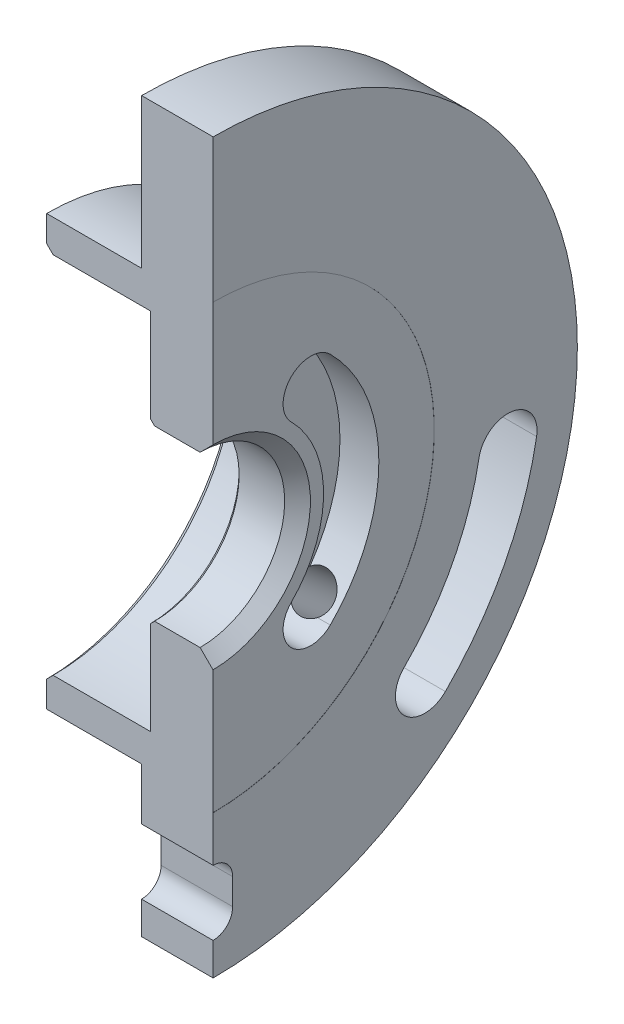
ISO-10303-21;
HEADER;
FILE_DESCRIPTION(('STEP AP214'),'2;1');
FILE_NAME('part.step','',(''),(''),'','','');
FILE_SCHEMA(('AUTOMOTIVE_DESIGN { 1 0 10303 214 1 1 1 1 }'));
ENDSEC;
DATA;
#1=APPLICATION_CONTEXT('core data for automotive mechanical design processes');
#2=APPLICATION_PROTOCOL_DEFINITION('international standard','automotive_design',2000,#1);
#3=PRODUCT_CONTEXT('',#1,'mechanical');
#4=PRODUCT('Part','Part','',(#3));
#5=PRODUCT_RELATED_PRODUCT_CATEGORY('part','',(#4));
#6=PRODUCT_DEFINITION_FORMATION('','',#4);
#7=PRODUCT_DEFINITION_CONTEXT('part definition',#1,'design');
#8=PRODUCT_DEFINITION('design','',#6,#7);
#9=PRODUCT_DEFINITION_SHAPE('','',#8);
#10=(LENGTH_UNIT() NAMED_UNIT(*) SI_UNIT(.MILLI.,.METRE.));
#11=(NAMED_UNIT(*) PLANE_ANGLE_UNIT() SI_UNIT($,.RADIAN.));
#12=(NAMED_UNIT(*) SI_UNIT($,.STERADIAN.) SOLID_ANGLE_UNIT());
#13=UNCERTAINTY_MEASURE_WITH_UNIT(LENGTH_MEASURE(1.E-05),#10,'distance_accuracy_value','');
#14=(GEOMETRIC_REPRESENTATION_CONTEXT(3) GLOBAL_UNCERTAINTY_ASSIGNED_CONTEXT((#13)) GLOBAL_UNIT_ASSIGNED_CONTEXT((#10,
#11,#12)) REPRESENTATION_CONTEXT('',''));
#15=CARTESIAN_POINT('',(0.,0.,0.));
#16=DIRECTION('',(0.,0.,1.));
#17=DIRECTION('',(1.,0.,0.));
#18=AXIS2_PLACEMENT_3D('',#15,#16,#17);
#19=CARTESIAN_POINT('',(5.50000000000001,0.,0.));
#20=DIRECTION('',(1.,0.,0.));
#21=DIRECTION('',(0.,0.,-1.));
#22=AXIS2_PLACEMENT_3D('',#19,#20,#21);
#23=CONICAL_SURFACE('',#22,7.5,0.78539816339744);
#24=DIRECTION('',(-0.707106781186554,0.707106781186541,0.));
#25=VECTOR('',#24,1.);
#26=CARTESIAN_POINT('',(-2.00000000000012,0.,0.));
#27=LINE('',#26,#25);
#28=CARTESIAN_POINT('',(5.49,-7.48999999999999,0.));
#29=VERTEX_POINT('',#28);
#30=CARTESIAN_POINT('',(4.49999999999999,-6.5,0.));
#31=VERTEX_POINT('',#30);
#32=EDGE_CURVE('E853',#29,#31,#27,.T.);
#33=ORIENTED_EDGE('',*,*,#32,.F.);
#34=CARTESIAN_POINT('',(5.49,0.,0.));
#35=DIRECTION('',(1.,0.,0.));
#36=DIRECTION('',(0.,0.,-1.));
#37=AXIS2_PLACEMENT_3D('',#34,#35,#36);
#38=CIRCLE('',#37,7.48999999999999);
#39=CARTESIAN_POINT('',(5.49,7.48999999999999,0.));
#40=VERTEX_POINT('',#39);
#41=EDGE_CURVE('E545',#29,#40,#38,.T.);
#42=ORIENTED_EDGE('',*,*,#41,.T.);
#43=DIRECTION('',(0.707106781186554,0.707106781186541,0.));
#44=VECTOR('',#43,1.);
#45=CARTESIAN_POINT('',(-2.00000000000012,0.,0.));
#46=LINE('',#45,#44);
#47=CARTESIAN_POINT('',(4.49999999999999,6.5,0.));
#48=VERTEX_POINT('',#47);
#49=EDGE_CURVE('E813',#48,#40,#46,.T.);
#50=ORIENTED_EDGE('',*,*,#49,.F.);
#51=CARTESIAN_POINT('',(4.49999999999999,0.,0.));
#52=DIRECTION('',(-1.,0.,0.));
#53=DIRECTION('',(0.,0.,1.));
#54=AXIS2_PLACEMENT_3D('',#51,#52,#53);
#55=CIRCLE('',#54,6.5);
#56=EDGE_CURVE('E718',#31,#48,#55,.F.);
#57=ORIENTED_EDGE('',*,*,#56,.F.);
#58=EDGE_LOOP('',(#33,#42,#50,#57));
#59=FACE_BOUND('',#58,.T.);
#60=ADVANCED_FACE('F356',(#59),#23,.F.);
#61=CARTESIAN_POINT('',(2.5,0.,0.));
#62=DIRECTION('',(1.,0.,0.));
#63=DIRECTION('',(0.,0.,-1.));
#64=AXIS2_PLACEMENT_3D('',#61,#62,#63);
#65=CYLINDRICAL_SURFACE('',#64,8.5);
#66=CARTESIAN_POINT('',(5.49,0.,0.));
#67=DIRECTION('',(1.,0.,0.));
#68=DIRECTION('',(0.,0.,-1.));
#69=AXIS2_PLACEMENT_3D('',#66,#67,#68);
#70=CIRCLE('',#69,8.5);
#71=CARTESIAN_POINT('',(5.49,-6.01040764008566,-6.01040764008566));
#72=VERTEX_POINT('',#71);
#73=CARTESIAN_POINT('',(5.49,6.01040764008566,-6.01040764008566));
#74=VERTEX_POINT('',#73);
#75=EDGE_CURVE('E560',#72,#74,#70,.T.);
#76=ORIENTED_EDGE('',*,*,#75,.F.);
#77=DIRECTION('',(1.,0.,0.));
#78=VECTOR('',#77,1.);
#79=CARTESIAN_POINT('',(2.5,-6.01040764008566,-6.01040764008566));
#80=LINE('',#79,#78);
#81=CARTESIAN_POINT('',(2.5,-6.01040764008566,-6.01040764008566));
#82=VERTEX_POINT('',#81);
#83=EDGE_CURVE('E757',#82,#72,#80,.T.);
#84=ORIENTED_EDGE('',*,*,#83,.F.);
#85=CARTESIAN_POINT('',(2.5,0.,0.));
#86=DIRECTION('',(-1.,0.,0.));
#87=DIRECTION('',(0.,0.,1.));
#88=AXIS2_PLACEMENT_3D('',#85,#86,#87);
#89=CIRCLE('',#88,8.5);
#90=CARTESIAN_POINT('',(2.5,6.01040764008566,-6.01040764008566));
#91=VERTEX_POINT('',#90);
#92=EDGE_CURVE('E1022',#91,#82,#89,.T.);
#93=ORIENTED_EDGE('',*,*,#92,.F.);
#94=DIRECTION('',(1.,0.,0.));
#95=VECTOR('',#94,1.);
#96=CARTESIAN_POINT('',(2.5,6.01040764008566,-6.01040764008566));
#97=LINE('',#96,#95);
#98=EDGE_CURVE('E759',#91,#74,#97,.T.);
#99=ORIENTED_EDGE('',*,*,#98,.T.);
#100=EDGE_LOOP('',(#76,#84,#93,#99));
#101=FACE_BOUND('',#100,.T.);
#102=ADVANCED_FACE('F643',(#101),#65,.T.);
#103=CARTESIAN_POINT('',(2.5,7.51300955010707,-7.51300955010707));
#104=DIRECTION('',(1.,0.,0.));
#105=DIRECTION('',(0.,0.,-1.));
#106=AXIS2_PLACEMENT_3D('',#103,#104,#105);
#107=CYLINDRICAL_SURFACE('',#106,2.125);
#108=CARTESIAN_POINT('',(5.49,7.51300955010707,-7.51300955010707));
#109=DIRECTION('',(1.,0.,0.));
#110=DIRECTION('',(0.,0.,-1.));
#111=AXIS2_PLACEMENT_3D('',#108,#109,#110);
#112=CIRCLE('',#111,2.125);
#113=CARTESIAN_POINT('',(5.49,9.01561146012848,-9.01561146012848));
#114=VERTEX_POINT('',#113);
#115=EDGE_CURVE('E553',#74,#114,#112,.F.);
#116=ORIENTED_EDGE('',*,*,#115,.F.);
#117=ORIENTED_EDGE('',*,*,#98,.F.);
#118=CARTESIAN_POINT('',(2.5,7.51300955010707,-7.51300955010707));
#119=DIRECTION('',(1.,0.,0.));
#120=DIRECTION('',(0.,0.,1.));
#121=AXIS2_PLACEMENT_3D('',#118,#119,#120);
#122=CIRCLE('',#121,2.125);
#123=CARTESIAN_POINT('',(2.5,9.01561146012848,-9.01561146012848));
#124=VERTEX_POINT('',#123);
#125=EDGE_CURVE('E764',#124,#91,#122,.T.);
#126=ORIENTED_EDGE('',*,*,#125,.F.);
#127=DIRECTION('',(1.,0.,0.));
#128=VECTOR('',#127,1.);
#129=CARTESIAN_POINT('',(2.5,9.01561146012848,-9.01561146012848));
#130=LINE('',#129,#128);
#131=EDGE_CURVE('E766',#124,#114,#130,.T.);
#132=ORIENTED_EDGE('',*,*,#131,.T.);
#133=EDGE_LOOP('',(#116,#117,#126,#132));
#134=FACE_BOUND('',#133,.T.);
#135=ADVANCED_FACE('F640',(#134),#107,.F.);
#136=CARTESIAN_POINT('',(2.5,0.,0.));
#137=DIRECTION('',(1.,0.,0.));
#138=DIRECTION('',(0.,0.,-1.));
#139=AXIS2_PLACEMENT_3D('',#136,#137,#138);
#140=CYLINDRICAL_SURFACE('',#139,12.75);
#141=CARTESIAN_POINT('',(5.49,0.,0.));
#142=DIRECTION('',(1.,0.,0.));
#143=DIRECTION('',(0.,0.,-1.));
#144=AXIS2_PLACEMENT_3D('',#141,#142,#143);
#145=CIRCLE('',#144,12.75);
#146=CARTESIAN_POINT('',(5.49,-9.01561146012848,-9.01561146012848));
#147=VERTEX_POINT('',#146);
#148=EDGE_CURVE('E550',#114,#147,#145,.F.);
#149=ORIENTED_EDGE('',*,*,#148,.F.);
#150=ORIENTED_EDGE('',*,*,#131,.F.);
#151=CARTESIAN_POINT('',(2.5,0.,0.));
#152=DIRECTION('',(1.,0.,0.));
#153=DIRECTION('',(0.,0.,1.));
#154=AXIS2_PLACEMENT_3D('',#151,#152,#153);
#155=CIRCLE('',#154,12.75);
#156=CARTESIAN_POINT('',(2.5,-7.30619998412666,-10.4490163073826));
#157=VERTEX_POINT('',#156);
#158=EDGE_CURVE('E769',#157,#124,#155,.T.);
#159=ORIENTED_EDGE('',*,*,#158,.F.);
#160=CARTESIAN_POINT('',(2.5,-7.30619998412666,-10.4490163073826));
#161=CARTESIAN_POINT('',(2.53143186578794,-7.28314516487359,-10.4651366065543));
#162=CARTESIAN_POINT('',(2.56403003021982,-7.26112966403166,-10.4804169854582));
#163=CARTESIAN_POINT('',(2.63135797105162,-7.21934058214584,-10.5092466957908));
#164=CARTESIAN_POINT('',(2.66608770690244,-7.19956695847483,-10.5227960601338));
#165=CARTESIAN_POINT('',(2.77307880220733,-7.14390243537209,-10.5607376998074));
#166=CARTESIAN_POINT('',(2.84822754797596,-7.11160510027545,-10.5824670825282));
#167=CARTESIAN_POINT('',(3.00401186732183,-7.05784008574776,-10.6184013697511));
#168=CARTESIAN_POINT('',(3.08465081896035,-7.03637914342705,-10.6326015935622));
#169=CARTESIAN_POINT('',(3.24910194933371,-7.00508540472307,-10.65324519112));
#170=CARTESIAN_POINT('',(3.33291312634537,-6.99524896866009,-10.6596909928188));
#171=CARTESIAN_POINT('',(3.5009327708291,-6.98758660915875,-10.664715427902));
#172=CARTESIAN_POINT('',(3.58513772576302,-6.98970655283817,-10.6633295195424));
#173=CARTESIAN_POINT('',(3.75193608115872,-7.00575082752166,-10.6527951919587));
#174=CARTESIAN_POINT('',(3.83452920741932,-7.01967714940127,-10.6436454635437));
#175=CARTESIAN_POINT('',(3.9956104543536,-7.05878814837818,-10.6177471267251));
#176=CARTESIAN_POINT('',(4.07410520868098,-7.08395395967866,-10.6010112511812));
#177=CARTESIAN_POINT('',(4.22494473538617,-7.14463086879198,-10.5602121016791));
#178=CARTESIAN_POINT('',(4.29728971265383,-7.18014162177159,-10.5361490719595));
#179=CARTESIAN_POINT('',(4.43421550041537,-7.26049540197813,-10.4809392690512));
#180=CARTESIAN_POINT('',(4.49875120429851,-7.30538890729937,-10.4497540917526));
#181=CARTESIAN_POINT('',(4.61779921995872,-7.40286469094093,-10.3809270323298));
#182=CARTESIAN_POINT('',(4.67231101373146,-7.4554473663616,-10.3432848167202));
#183=CARTESIAN_POINT('',(4.76997998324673,-7.56679773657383,-10.2621065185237));
#184=CARTESIAN_POINT('',(4.81309030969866,-7.62558960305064,-10.2185471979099));
#185=CARTESIAN_POINT('',(4.88642438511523,-7.74728532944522,-10.1265926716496));
#186=CARTESIAN_POINT('',(4.9166485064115,-7.81018907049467,-10.078197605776));
#187=CARTESIAN_POINT('',(4.96323955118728,-7.93790377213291,-9.97791298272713));
#188=CARTESIAN_POINT('',(4.97965630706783,-8.00270699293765,-9.92603672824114));
#189=CARTESIAN_POINT('',(4.99832802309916,-8.13247590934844,-9.81999762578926));
#190=CARTESIAN_POINT('',(5.00058422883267,-8.19744159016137,-9.76583497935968));
#191=CARTESIAN_POINT('',(4.99089991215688,-8.32528611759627,-9.65707595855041));
#192=CARTESIAN_POINT('',(4.97904096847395,-8.38817481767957,-9.60248387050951));
#193=CARTESIAN_POINT('',(4.94160218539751,-8.51057038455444,-9.49417580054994));
#194=CARTESIAN_POINT('',(4.91601789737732,-8.57007614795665,-9.44046010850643));
#195=CARTESIAN_POINT('',(4.85182769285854,-8.68425647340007,-9.33553536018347));
#196=CARTESIAN_POINT('',(4.81319952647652,-8.7389225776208,-9.28433075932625));
#197=CARTESIAN_POINT('',(4.72404625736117,-8.84196872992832,-9.18624748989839));
#198=CARTESIAN_POINT('',(4.67353876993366,-8.89035792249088,-9.13936255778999));
#199=CARTESIAN_POINT('',(4.60018577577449,-8.94924020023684,-9.08151967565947));
#200=CARTESIAN_POINT('',(4.58198005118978,-8.963062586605,-9.06787567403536));
#201=CARTESIAN_POINT('',(4.54459774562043,-8.9899221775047,-9.04124738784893));
#202=CARTESIAN_POINT('',(4.52542283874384,-9.00296065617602,-9.02826203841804));
#203=CARTESIAN_POINT('',(4.50576820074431,-9.01561146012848,-9.01561146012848));
#204=B_SPLINE_CURVE_WITH_KNOTS('',3,(#160,#161,#162,#163,#164,#165,#166,#167,#168,#169,#170,
#171,#172,#173,#174,#175,#176,#177,#178,#179,#180,#181,#182,#183,#184,#185,#186,#187,#188,#189,
#190,#191,#192,#193,#194,#195,#196,#197,#198,#199,#200,#201,#202,#203),.UNSPECIFIED.,.F.,.F.,(4,
2,2,2,2,2,2,2,2,2,2,2,2,2,2,2,2,2,2,2,2,4),(0.,0.126469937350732,0.25293746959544,
0.505532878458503,0.758285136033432,1.01095823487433,1.26248826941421,1.51406072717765,
1.76521249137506,2.01635588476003,2.26888688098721,2.52143092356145,2.77499710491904,
3.02855595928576,3.28119571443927,3.53381324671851,3.78497783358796,4.03622387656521,
4.28790067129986,4.53920659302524,4.61904261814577,4.69874516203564),.UNSPECIFIED.);
#205=CARTESIAN_POINT('',(4.50576820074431,-9.01561146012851,-9.01561146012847));
#206=VERTEX_POINT('',#205);
#207=EDGE_CURVE('E590',#157,#206,#204,.T.);
#208=ORIENTED_EDGE('',*,*,#207,.T.);
#209=DIRECTION('',(1.,0.,0.));
#210=VECTOR('',#209,1.);
#211=CARTESIAN_POINT('',(2.5,-9.01561146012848,-9.01561146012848));
#212=LINE('',#211,#210);
#213=EDGE_CURVE('E763',#206,#147,#212,.T.);
#214=ORIENTED_EDGE('',*,*,#213,.T.);
#215=EDGE_LOOP('',(#149,#150,#159,#208,#214));
#216=FACE_BOUND('',#215,.T.);
#217=ADVANCED_FACE('F642',(#216),#140,.F.);
#218=CARTESIAN_POINT('',(2.5,-7.51300955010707,-7.51300955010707));
#219=DIRECTION('',(1.,0.,0.));
#220=DIRECTION('',(0.,0.,-1.));
#221=AXIS2_PLACEMENT_3D('',#218,#219,#220);
#222=CYLINDRICAL_SURFACE('',#221,2.125);
#223=CARTESIAN_POINT('',(5.49,-7.51300955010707,-7.51300955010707));
#224=DIRECTION('',(1.,0.,0.));
#225=DIRECTION('',(0.,0.,-1.));
#226=AXIS2_PLACEMENT_3D('',#223,#224,#225);
#227=CIRCLE('',#226,2.125);
#228=EDGE_CURVE('E748',#147,#72,#227,.F.);
#229=ORIENTED_EDGE('',*,*,#228,.F.);
#230=ORIENTED_EDGE('',*,*,#213,.F.);
#231=CARTESIAN_POINT('',(4.45169318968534,-6.1836096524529,-9.17081560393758));
#232=CARTESIAN_POINT('',(4.46650638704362,-6.23217280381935,-9.20973833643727));
#233=CARTESIAN_POINT('',(4.48376455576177,-6.2818771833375,-9.24611233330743));
#234=CARTESIAN_POINT('',(4.52159919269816,-6.38326485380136,-9.31385066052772));
#235=CARTESIAN_POINT('',(4.54216939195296,-6.43494426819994,-9.34522423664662));
#236=CARTESIAN_POINT('',(4.58523036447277,-6.54042383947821,-9.40333842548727));
#237=CARTESIAN_POINT('',(4.60773019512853,-6.59423327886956,-9.43005517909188));
#238=CARTESIAN_POINT('',(4.65337749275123,-6.70369745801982,-9.47877354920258));
#239=CARTESIAN_POINT('',(4.67652526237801,-6.75935306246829,-9.50077291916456));
#240=CARTESIAN_POINT('',(4.74287476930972,-6.92282035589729,-9.55754510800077));
#241=CARTESIAN_POINT('',(4.78560557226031,-7.03300249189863,-9.5862810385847));
#242=CARTESIAN_POINT('',(4.86355464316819,-7.25889356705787,-9.62585365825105));
#243=CARTESIAN_POINT('',(4.89879636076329,-7.37458382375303,-9.6367469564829));
#244=CARTESIAN_POINT('',(4.9473751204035,-7.57503212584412,-9.63872509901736));
#245=CARTESIAN_POINT('',(4.96410522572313,-7.65890773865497,-9.63468361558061));
#246=CARTESIAN_POINT('',(4.98840619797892,-7.82694344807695,-9.61638630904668));
#247=CARTESIAN_POINT('',(4.99598136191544,-7.9111033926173,-9.60213528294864));
#248=CARTESIAN_POINT('',(4.99962172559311,-8.07818791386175,-9.56328076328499));
#249=CARTESIAN_POINT('',(4.99557868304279,-8.16109359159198,-9.53858175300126));
#250=CARTESIAN_POINT('',(4.97384924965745,-8.32169805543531,-9.47996959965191));
#251=CARTESIAN_POINT('',(4.95617670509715,-8.39940203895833,-9.44606583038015));
#252=CARTESIAN_POINT('',(4.91003165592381,-8.53626821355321,-9.3767753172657));
#253=CARTESIAN_POINT('',(4.88341176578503,-8.5965044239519,-9.34225669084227));
#254=CARTESIAN_POINT('',(4.8200068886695,-8.7094932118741,-9.27043187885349));
#255=CARTESIAN_POINT('',(4.783221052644,-8.76224516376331,-9.23312546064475));
#256=CARTESIAN_POINT('',(4.70150609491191,-8.85827578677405,-9.15905794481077));
#257=CARTESIAN_POINT('',(4.6568101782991,-8.90176282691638,-9.12230742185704));
#258=CARTESIAN_POINT('',(4.55978251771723,-8.98087938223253,-9.05048850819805));
#259=CARTESIAN_POINT('',(4.50744842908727,-9.01650647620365,-9.01542063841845));
#260=CARTESIAN_POINT('',(4.39092068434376,-9.08326137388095,-8.94566049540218));
#261=CARTESIAN_POINT('',(4.32606977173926,-9.11362221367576,-8.91133166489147));
#262=CARTESIAN_POINT('',(4.19008147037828,-9.16582022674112,-8.84923247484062));
#263=CARTESIAN_POINT('',(4.11894138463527,-9.18765372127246,-8.82146494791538));
#264=CARTESIAN_POINT('',(3.96678073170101,-9.22462311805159,-8.77277610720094));
#265=CARTESIAN_POINT('',(3.88541718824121,-9.23917746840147,-8.7524764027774));
#266=CARTESIAN_POINT('',(3.71961009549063,-9.25965818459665,-8.72344987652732));
#267=CARTESIAN_POINT('',(3.63516758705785,-9.26558743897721,-8.7147191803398));
#268=CARTESIAN_POINT('',(3.46779808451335,-9.26900503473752,-8.70971875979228));
#269=CARTESIAN_POINT('',(3.38488400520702,-9.26669460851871,-8.71315195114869));
#270=CARTESIAN_POINT('',(3.22096845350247,-9.2539944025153,-8.73149945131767));
#271=CARTESIAN_POINT('',(3.13996722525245,-9.2436035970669,-8.74641521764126));
#272=CARTESIAN_POINT('',(2.98291933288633,-9.21453428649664,-8.78620733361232));
#273=CARTESIAN_POINT('',(2.90683097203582,-9.19594033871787,-8.81098181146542));
#274=CARTESIAN_POINT('',(2.76056970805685,-9.14991291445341,-8.86856346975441));
#275=CARTESIAN_POINT('',(2.69039917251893,-9.1224759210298,-8.90137384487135));
#276=CARTESIAN_POINT('',(2.55527651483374,-9.05690937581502,-8.97399331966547));
#277=CARTESIAN_POINT('',(2.49060854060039,-9.0184259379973,-9.01401424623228));
#278=CARTESIAN_POINT('',(2.37140051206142,-8.93063866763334,-9.09717988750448));
#279=CARTESIAN_POINT('',(2.31685539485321,-8.88134027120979,-9.14032302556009));
#280=CARTESIAN_POINT('',(2.2219865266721,-8.77446396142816,-9.22436968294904));
#281=CARTESIAN_POINT('',(2.18111620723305,-8.71738217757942,-9.26528342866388));
#282=CARTESIAN_POINT('',(2.11152651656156,-8.5942699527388,-9.34380442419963));
#283=CARTESIAN_POINT('',(2.08279627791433,-8.52824758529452,-9.38141460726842));
#284=CARTESIAN_POINT('',(2.04021998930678,-8.3962818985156,-9.44700103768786));
#285=CARTESIAN_POINT('',(2.02515197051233,-8.33102141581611,-9.47556923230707));
#286=CARTESIAN_POINT('',(2.00473479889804,-8.1966334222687,-9.52632588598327));
#287=CARTESIAN_POINT('',(1.99938670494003,-8.12750549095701,-9.54851364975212));
#288=CARTESIAN_POINT('',(1.99738914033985,-7.98684190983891,-9.58579484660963));
#289=CARTESIAN_POINT('',(2.00079238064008,-7.91529424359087,-9.60084464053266));
#290=CARTESIAN_POINT('',(2.01499025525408,-7.77178661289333,-9.62344760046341));
#291=CARTESIAN_POINT('',(2.02578806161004,-7.69982648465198,-9.63099754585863));
#292=CARTESIAN_POINT('',(2.05997287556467,-7.52175868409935,-9.64066242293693));
#293=CARTESIAN_POINT('',(2.08693015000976,-7.4160918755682,-9.63833846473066));
#294=CARTESIAN_POINT('',(2.14919784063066,-7.2085836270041,-9.61868803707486));
#295=CARTESIAN_POINT('',(2.18453209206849,-7.10675408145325,-9.60131837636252));
#296=CARTESIAN_POINT('',(2.2601871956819,-6.90541616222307,-9.5520023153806));
#297=CARTESIAN_POINT('',(2.30061650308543,-6.80604361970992,-9.51967688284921));
#298=CARTESIAN_POINT('',(2.38071444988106,-6.61307637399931,-9.44085302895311));
#299=CARTESIAN_POINT('',(2.420385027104,-6.51946503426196,-9.39439796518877));
#300=CARTESIAN_POINT('',(2.47332236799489,-6.38661181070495,-9.31557791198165));
#301=CARTESIAN_POINT('',(2.48937024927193,-6.34504822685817,-9.288949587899));
#302=CARTESIAN_POINT('',(2.51907641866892,-6.2632720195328,-9.23238527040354));
#303=CARTESIAN_POINT('',(2.53273180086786,-6.22306108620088,-9.20244532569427));
#304=CARTESIAN_POINT('',(2.5447450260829,-6.1836096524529,-9.17081560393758));
#305=B_SPLINE_CURVE_WITH_KNOTS('',3,(#231,#232,#233,#234,#235,#236,#237,#238,#239,#240,#241,
#242,#243,#244,#245,#246,#247,#248,#249,#250,#251,#252,#253,#254,#255,#256,#257,#258,#259,#260,
#261,#262,#263,#264,#265,#266,#267,#268,#269,#270,#271,#272,#273,#274,#275,#276,#277,#278,#279,
#280,#281,#282,#283,#284,#285,#286,#287,#288,#289,#290,#291,#292,#293,#294,#295,#296,#297,#298,
#299,#300,#301,#302,#303,#304),.UNSPECIFIED.,.F.,.F.,(4,2,2,2,2,2,2,2,2,2,2,2,2,2,2,2,2,2,2,2,2,
2,2,2,2,2,2,2,2,2,2,2,2,2,2,2,4),(0.,0.191649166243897,0.382939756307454,0.57518331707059,
0.767518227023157,1.13088209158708,1.49309086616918,1.74903822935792,2.00486541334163,
2.2630837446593,2.52104009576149,2.74297697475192,2.96493239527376,3.18119183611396,
3.3975178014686,3.63473850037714,3.87206142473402,4.12613633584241,4.38012613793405,
4.62795584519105,4.87581701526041,5.1211808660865,5.36664242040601,5.62106785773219,
5.875365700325,6.11774913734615,6.35991513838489,6.57730791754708,6.79472437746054,
7.01345344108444,7.23227639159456,7.55769050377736,7.88404188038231,8.21915983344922,
8.5532596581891,8.70882022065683,8.86456843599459),.UNSPECIFIED.);
#306=CARTESIAN_POINT('',(2.5,-9.02155498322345,-9.00964433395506));
#307=VERTEX_POINT('',#306);
#308=EDGE_CURVE('E582',#206,#307,#305,.T.);
#309=ORIENTED_EDGE('',*,*,#308,.T.);
#310=CARTESIAN_POINT('',(2.5,-7.51300955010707,-7.51300955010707));
#311=DIRECTION('',(1.,0.,0.));
#312=DIRECTION('',(0.,0.,-1.));
#313=AXIS2_PLACEMENT_3D('',#310,#311,#312);
#314=CIRCLE('',#313,2.125);
#315=EDGE_CURVE('E761',#82,#307,#314,.T.);
#316=ORIENTED_EDGE('',*,*,#315,.F.);
#317=ORIENTED_EDGE('',*,*,#83,.T.);
#318=EDGE_LOOP('',(#229,#230,#309,#316,#317));
#319=FACE_BOUND('',#318,.T.);
#320=ADVANCED_FACE('F596',(#319),#222,.F.);
#321=CARTESIAN_POINT('',(5.5,28.,0.));
#322=DIRECTION('',(-1.,0.,0.));
#323=DIRECTION('',(0.,0.,1.));
#324=AXIS2_PLACEMENT_3D('',#321,#322,#323);
#325=PLANE('',#324);
#326=CARTESIAN_POINT('',(5.5,0.,0.));
#327=DIRECTION('',(1.,0.,0.));
#328=DIRECTION('',(0.,0.,-1.));
#329=AXIS2_PLACEMENT_3D('',#326,#327,#328);
#330=CIRCLE('',#329,17.);
#331=CARTESIAN_POINT('',(5.5,-17.,0.));
#332=VERTEX_POINT('',#331);
#333=CARTESIAN_POINT('',(5.5,17.,0.));
#334=VERTEX_POINT('',#333);
#335=EDGE_CURVE('E551',#332,#334,#330,.T.);
#336=ORIENTED_EDGE('',*,*,#335,.F.);
#337=DIRECTION('',(0.,-1.,0.));
#338=VECTOR('',#337,1.);
#339=CARTESIAN_POINT('',(5.5,28.,0.));
#340=LINE('',#339,#338);
#341=CARTESIAN_POINT('',(5.5,-20.5,0.));
#342=VERTEX_POINT('',#341);
#343=EDGE_CURVE('E379',#332,#342,#340,.T.);
#344=ORIENTED_EDGE('',*,*,#343,.T.);
#345=CARTESIAN_POINT('',(5.5,-22.,0.));
#346=DIRECTION('',(1.,0.,0.));
#347=DIRECTION('',(0.,0.,-1.));
#348=AXIS2_PLACEMENT_3D('',#345,#346,#347);
#349=CIRCLE('',#348,1.5);
#350=CARTESIAN_POINT('',(5.5,-22.,-1.5));
#351=VERTEX_POINT('',#350);
#352=EDGE_CURVE('E563',#351,#342,#349,.T.);
#353=ORIENTED_EDGE('',*,*,#352,.F.);
#354=DIRECTION('',(0.,1.,0.));
#355=VECTOR('',#354,1.);
#356=CARTESIAN_POINT('',(5.5,-22.,-1.5));
#357=LINE('',#356,#355);
#358=CARTESIAN_POINT('',(5.5,-24.,-1.5));
#359=VERTEX_POINT('',#358);
#360=EDGE_CURVE('E568',#359,#351,#357,.T.);
#361=ORIENTED_EDGE('',*,*,#360,.F.);
#362=CARTESIAN_POINT('',(5.5,-24.,0.));
#363=DIRECTION('',(1.,0.,0.));
#364=DIRECTION('',(0.,0.,-1.));
#365=AXIS2_PLACEMENT_3D('',#362,#363,#364);
#366=CIRCLE('',#365,1.5);
#367=CARTESIAN_POINT('',(5.5,-25.5,0.));
#368=VERTEX_POINT('',#367);
#369=EDGE_CURVE('E566',#368,#359,#366,.T.);
#370=ORIENTED_EDGE('',*,*,#369,.F.);
#371=CARTESIAN_POINT('',(5.50000000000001,-28.,0.));
#372=VERTEX_POINT('',#371);
#373=EDGE_CURVE('E371',#368,#372,#340,.T.);
#374=ORIENTED_EDGE('',*,*,#373,.T.);
#375=CARTESIAN_POINT('',(5.50000000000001,0.,0.));
#376=DIRECTION('',(-1.,0.,0.));
#377=DIRECTION('',(0.,0.,1.));
#378=AXIS2_PLACEMENT_3D('',#375,#376,#377);
#379=CIRCLE('',#378,28.);
#380=CARTESIAN_POINT('',(5.5,28.,0.));
#381=VERTEX_POINT('',#380);
#382=EDGE_CURVE('E701',#381,#372,#379,.T.);
#383=ORIENTED_EDGE('',*,*,#382,.F.);
#384=DIRECTION('',(0.,-1.,0.));
#385=VECTOR('',#384,1.);
#386=CARTESIAN_POINT('',(5.5,28.,0.));
#387=LINE('',#386,#385);
#388=EDGE_CURVE('E811',#381,#334,#387,.T.);
#389=ORIENTED_EDGE('',*,*,#388,.T.);
#390=EDGE_LOOP('',(#336,#344,#353,#361,#370,#374,#383,#389));
#391=FACE_BOUND('',#390,.T.);
#392=CARTESIAN_POINT('',(5.5,-3.99390808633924,-22.6505783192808));
#393=DIRECTION('',(1.,0.,0.));
#394=DIRECTION('',(0.,0.,1.));
#395=AXIS2_PLACEMENT_3D('',#392,#393,#394);
#396=CIRCLE('',#395,2.24999999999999);
#397=CARTESIAN_POINT('',(5.5,-4.38461648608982,-24.8663957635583));
#398=VERTEX_POINT('',#397);
#399=CARTESIAN_POINT('',(5.5,-3.60319968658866,-20.4347608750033));
#400=VERTEX_POINT('',#399);
#401=EDGE_CURVE('E1013',#398,#400,#396,.T.);
#402=ORIENTED_EDGE('',*,*,#401,.F.);
#403=CARTESIAN_POINT('',(5.5,0.,0.));
#404=DIRECTION('',(1.,0.,0.));
#405=DIRECTION('',(0.,0.,1.));
#406=AXIS2_PLACEMENT_3D('',#403,#404,#405);
#407=CIRCLE('',#406,25.25);
#408=CARTESIAN_POINT('',(5.5,-17.8544462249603,-17.8544462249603));
#409=VERTEX_POINT('',#408);
#410=EDGE_CURVE('E1015',#409,#398,#407,.T.);
#411=ORIENTED_EDGE('',*,*,#410,.F.);
#412=CARTESIAN_POINT('',(5.5,-16.2634559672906,-16.2634559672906));
#413=DIRECTION('',(1.,0.,0.));
#414=DIRECTION('',(0.,0.,1.));
#415=AXIS2_PLACEMENT_3D('',#412,#413,#414);
#416=CIRCLE('',#415,2.25);
#417=CARTESIAN_POINT('',(5.5,-14.6724657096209,-14.6724657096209));
#418=VERTEX_POINT('',#417);
#419=EDGE_CURVE('E1002',#418,#409,#416,.T.);
#420=ORIENTED_EDGE('',*,*,#419,.F.);
#421=CARTESIAN_POINT('',(5.5,0.,0.));
#422=DIRECTION('',(-1.,0.,0.));
#423=DIRECTION('',(0.,0.,1.));
#424=AXIS2_PLACEMENT_3D('',#421,#422,#423);
#425=CIRCLE('',#424,20.75);
#426=EDGE_CURVE('E1010',#400,#418,#425,.T.);
#427=ORIENTED_EDGE('',*,*,#426,.F.);
#428=EDGE_LOOP('',(#402,#411,#420,#427));
#429=FACE_BOUND('',#428,.T.);
#430=ADVANCED_FACE('F358',(#391,#429),#325,.F.);
#431=CARTESIAN_POINT('',(-120.,0.,0.));
#432=DIRECTION('',(-1.,0.,0.));
#433=DIRECTION('',(0.,0.,1.));
#434=AXIS2_PLACEMENT_3D('',#431,#432,#433);
#435=CYLINDRICAL_SURFACE('',#434,28.);
#436=ORIENTED_EDGE('',*,*,#382,.T.);
#437=DIRECTION('',(-1.,0.,0.));
#438=VECTOR('',#437,1.);
#439=CARTESIAN_POINT('',(-120.,-28.,0.));
#440=LINE('',#439,#438);
#441=CARTESIAN_POINT('',(0.,-28.,0.));
#442=VERTEX_POINT('',#441);
#443=EDGE_CURVE('E703',#372,#442,#440,.T.);
#444=ORIENTED_EDGE('',*,*,#443,.T.);
#445=CARTESIAN_POINT('',(0.,0.,0.));
#446=DIRECTION('',(-1.,0.,0.));
#447=DIRECTION('',(0.,0.,1.));
#448=AXIS2_PLACEMENT_3D('',#445,#446,#447);
#449=CIRCLE('',#448,28.);
#450=CARTESIAN_POINT('',(0.,28.,0.));
#451=VERTEX_POINT('',#450);
#452=EDGE_CURVE('E708',#451,#442,#449,.T.);
#453=ORIENTED_EDGE('',*,*,#452,.F.);
#454=DIRECTION('',(-1.,0.,0.));
#455=VECTOR('',#454,1.);
#456=CARTESIAN_POINT('',(-120.,28.,0.));
#457=LINE('',#456,#455);
#458=EDGE_CURVE('E705',#451,#381,#457,.F.);
#459=ORIENTED_EDGE('',*,*,#458,.T.);
#460=EDGE_LOOP('',(#436,#444,#453,#459));
#461=FACE_BOUND('',#460,.T.);
#462=ADVANCED_FACE('F690',(#461),#435,.T.);
#463=CARTESIAN_POINT('',(0.,28.,0.));
#464=DIRECTION('',(1.,0.,0.));
#465=DIRECTION('',(0.,0.,-1.));
#466=AXIS2_PLACEMENT_3D('',#463,#464,#465);
#467=PLANE('',#466);
#468=ORIENTED_EDGE('',*,*,#452,.T.);
#469=DIRECTION('',(0.,1.,0.));
#470=VECTOR('',#469,1.);
#471=CARTESIAN_POINT('',(0.,28.,0.));
#472=LINE('',#471,#470);
#473=CARTESIAN_POINT('',(0.,-25.5,0.));
#474=VERTEX_POINT('',#473);
#475=EDGE_CURVE('E792',#442,#474,#472,.T.);
#476=ORIENTED_EDGE('',*,*,#475,.T.);
#477=CARTESIAN_POINT('',(0.,-24.,0.));
#478=DIRECTION('',(1.,0.,0.));
#479=DIRECTION('',(0.,0.,-1.));
#480=AXIS2_PLACEMENT_3D('',#477,#478,#479);
#481=CIRCLE('',#480,1.5);
#482=CARTESIAN_POINT('',(0.,-24.,-1.5));
#483=VERTEX_POINT('',#482);
#484=EDGE_CURVE('E734',#474,#483,#481,.T.);
#485=ORIENTED_EDGE('',*,*,#484,.T.);
#486=DIRECTION('',(0.,1.,0.));
#487=VECTOR('',#486,1.);
#488=CARTESIAN_POINT('',(0.,28.,-1.5));
#489=LINE('',#488,#487);
#490=CARTESIAN_POINT('',(0.,-22.,-1.5));
#491=VERTEX_POINT('',#490);
#492=EDGE_CURVE('E738',#483,#491,#489,.T.);
#493=ORIENTED_EDGE('',*,*,#492,.T.);
#494=CARTESIAN_POINT('',(0.,-22.,0.));
#495=DIRECTION('',(1.,0.,0.));
#496=DIRECTION('',(0.,0.,-1.));
#497=AXIS2_PLACEMENT_3D('',#494,#495,#496);
#498=CIRCLE('',#497,1.5);
#499=CARTESIAN_POINT('',(0.,-20.5,0.));
#500=VERTEX_POINT('',#499);
#501=EDGE_CURVE('E743',#491,#500,#498,.T.);
#502=ORIENTED_EDGE('',*,*,#501,.T.);
#503=CARTESIAN_POINT('',(0.,-16.5,0.));
#504=VERTEX_POINT('',#503);
#505=EDGE_CURVE('E787',#500,#504,#472,.T.);
#506=ORIENTED_EDGE('',*,*,#505,.T.);
#507=CARTESIAN_POINT('',(0.,0.,0.));
#508=DIRECTION('',(-1.,0.,0.));
#509=DIRECTION('',(0.,0.,1.));
#510=AXIS2_PLACEMENT_3D('',#507,#508,#509);
#511=CIRCLE('',#510,16.5);
#512=CARTESIAN_POINT('',(0.,16.5,0.));
#513=VERTEX_POINT('',#512);
#514=EDGE_CURVE('E713',#513,#504,#511,.T.);
#515=ORIENTED_EDGE('',*,*,#514,.F.);
#516=DIRECTION('',(0.,1.,0.));
#517=VECTOR('',#516,1.);
#518=CARTESIAN_POINT('',(0.,28.,0.));
#519=LINE('',#518,#517);
#520=EDGE_CURVE('E786',#513,#451,#519,.T.);
#521=ORIENTED_EDGE('',*,*,#520,.T.);
#522=EDGE_LOOP('',(#468,#476,#485,#493,#502,#506,#515,#521));
#523=FACE_BOUND('',#522,.T.);
#524=CARTESIAN_POINT('',(0.,-16.2634559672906,-16.2634559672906));
#525=DIRECTION('',(1.,0.,0.));
#526=DIRECTION('',(0.,0.,-1.));
#527=AXIS2_PLACEMENT_3D('',#524,#525,#526);
#528=CIRCLE('',#527,2.25);
#529=CARTESIAN_POINT('',(0.,-14.6724657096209,-14.6724657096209));
#530=VERTEX_POINT('',#529);
#531=CARTESIAN_POINT('',(0.,-17.8544462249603,-17.8544462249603));
#532=VERTEX_POINT('',#531);
#533=EDGE_CURVE('E730',#530,#532,#528,.T.);
#534=ORIENTED_EDGE('',*,*,#533,.T.);
#535=CARTESIAN_POINT('',(0.,0.,0.));
#536=DIRECTION('',(1.,0.,0.));
#537=DIRECTION('',(0.,0.,-1.));
#538=AXIS2_PLACEMENT_3D('',#535,#536,#537);
#539=CIRCLE('',#538,25.25);
#540=CARTESIAN_POINT('',(0.,-4.38461648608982,-24.8663957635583));
#541=VERTEX_POINT('',#540);
#542=EDGE_CURVE('E618',#532,#541,#539,.T.);
#543=ORIENTED_EDGE('',*,*,#542,.T.);
#544=CARTESIAN_POINT('',(0.,-3.99390808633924,-22.6505783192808));
#545=DIRECTION('',(1.,0.,0.));
#546=DIRECTION('',(0.,0.,-1.));
#547=AXIS2_PLACEMENT_3D('',#544,#545,#546);
#548=CIRCLE('',#547,2.24999999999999);
#549=CARTESIAN_POINT('',(0.,-3.60319968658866,-20.4347608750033));
#550=VERTEX_POINT('',#549);
#551=EDGE_CURVE('E725',#541,#550,#548,.T.);
#552=ORIENTED_EDGE('',*,*,#551,.T.);
#553=CARTESIAN_POINT('',(0.,0.,0.));
#554=DIRECTION('',(1.,0.,0.));
#555=DIRECTION('',(0.,0.,-1.));
#556=AXIS2_PLACEMENT_3D('',#553,#554,#555);
#557=CIRCLE('',#556,20.75);
#558=EDGE_CURVE('E728',#550,#530,#557,.F.);
#559=ORIENTED_EDGE('',*,*,#558,.T.);
#560=EDGE_LOOP('',(#534,#543,#552,#559));
#561=FACE_BOUND('',#560,.T.);
#562=ADVANCED_FACE('F687',(#523,#561),#467,.F.);
#563=CARTESIAN_POINT('',(-120.,0.,0.));
#564=DIRECTION('',(-1.,0.,0.));
#565=DIRECTION('',(0.,0.,1.));
#566=AXIS2_PLACEMENT_3D('',#563,#564,#565);
#567=CYLINDRICAL_SURFACE('',#566,16.5);
#568=ORIENTED_EDGE('',*,*,#514,.T.);
#569=DIRECTION('',(-1.,0.,0.));
#570=VECTOR('',#569,1.);
#571=CARTESIAN_POINT('',(-120.,-16.5,0.));
#572=LINE('',#571,#570);
#573=CARTESIAN_POINT('',(-7.3,-16.5,0.));
#574=VERTEX_POINT('',#573);
#575=EDGE_CURVE('E783',#504,#574,#572,.T.);
#576=ORIENTED_EDGE('',*,*,#575,.T.);
#577=CARTESIAN_POINT('',(-7.3,0.,0.));
#578=DIRECTION('',(-1.,0.,0.));
#579=DIRECTION('',(0.,0.,1.));
#580=AXIS2_PLACEMENT_3D('',#577,#578,#579);
#581=CIRCLE('',#580,16.5);
#582=CARTESIAN_POINT('',(-7.3,16.5,0.));
#583=VERTEX_POINT('',#582);
#584=EDGE_CURVE('E776',#583,#574,#581,.T.);
#585=ORIENTED_EDGE('',*,*,#584,.F.);
#586=DIRECTION('',(-1.,0.,0.));
#587=VECTOR('',#586,1.);
#588=CARTESIAN_POINT('',(-120.,16.5,0.));
#589=LINE('',#588,#587);
#590=EDGE_CURVE('E555',#583,#513,#589,.F.);
#591=ORIENTED_EDGE('',*,*,#590,.T.);
#592=EDGE_LOOP('',(#568,#576,#585,#591));
#593=FACE_BOUND('',#592,.T.);
#594=ADVANCED_FACE('F683',(#593),#567,.T.);
#595=CARTESIAN_POINT('',(-7.3,16.5,0.));
#596=DIRECTION('',(1.,0.,0.));
#597=DIRECTION('',(0.,0.,-1.));
#598=AXIS2_PLACEMENT_3D('',#595,#596,#597);
#599=PLANE('',#598);
#600=ORIENTED_EDGE('',*,*,#584,.T.);
#601=DIRECTION('',(0.,1.,0.));
#602=VECTOR('',#601,1.);
#603=CARTESIAN_POINT('',(-7.3,16.5,0.));
#604=LINE('',#603,#602);
#605=CARTESIAN_POINT('',(-7.3,-14.5,0.));
#606=VERTEX_POINT('',#605);
#607=EDGE_CURVE('E800',#574,#606,#604,.T.);
#608=ORIENTED_EDGE('',*,*,#607,.T.);
#609=CARTESIAN_POINT('',(-7.3,0.,0.));
#610=DIRECTION('',(1.,0.,0.));
#611=DIRECTION('',(0.,0.,-1.));
#612=AXIS2_PLACEMENT_3D('',#609,#610,#611);
#613=CIRCLE('',#612,14.5);
#614=CARTESIAN_POINT('',(-7.3,14.5,0.));
#615=VERTEX_POINT('',#614);
#616=EDGE_CURVE('E711',#606,#615,#613,.T.);
#617=ORIENTED_EDGE('',*,*,#616,.T.);
#618=DIRECTION('',(0.,1.,0.));
#619=VECTOR('',#618,1.);
#620=CARTESIAN_POINT('',(-7.3,16.5,0.));
#621=LINE('',#620,#619);
#622=EDGE_CURVE('E831',#615,#583,#621,.T.);
#623=ORIENTED_EDGE('',*,*,#622,.T.);
#624=EDGE_LOOP('',(#600,#608,#617,#623));
#625=FACE_BOUND('',#624,.T.);
#626=ADVANCED_FACE('F679',(#625),#599,.F.);
#627=CARTESIAN_POINT('',(-120.,0.,0.));
#628=DIRECTION('',(-1.,0.,0.));
#629=DIRECTION('',(0.,0.,1.));
#630=AXIS2_PLACEMENT_3D('',#627,#628,#629);
#631=CYLINDRICAL_SURFACE('',#630,14.);
#632=CARTESIAN_POINT('',(-6.8,0.,0.));
#633=DIRECTION('',(1.,0.,0.));
#634=DIRECTION('',(0.,0.,-1.));
#635=AXIS2_PLACEMENT_3D('',#632,#633,#634);
#636=CIRCLE('',#635,14.);
#637=CARTESIAN_POINT('',(-6.8,14.,0.));
#638=VERTEX_POINT('',#637);
#639=CARTESIAN_POINT('',(-6.8,-14.,0.));
#640=VERTEX_POINT('',#639);
#641=EDGE_CURVE('E707',#638,#640,#636,.F.);
#642=ORIENTED_EDGE('',*,*,#641,.T.);
#643=DIRECTION('',(-1.,0.,0.));
#644=VECTOR('',#643,1.);
#645=CARTESIAN_POINT('',(-120.,-14.,0.));
#646=LINE('',#645,#644);
#647=CARTESIAN_POINT('',(0.699999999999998,-14.,0.));
#648=VERTEX_POINT('',#647);
#649=EDGE_CURVE('E842',#640,#648,#646,.F.);
#650=ORIENTED_EDGE('',*,*,#649,.T.);
#651=CARTESIAN_POINT('',(0.699999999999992,0.,0.));
#652=DIRECTION('',(-1.,0.,0.));
#653=DIRECTION('',(0.,0.,1.));
#654=AXIS2_PLACEMENT_3D('',#651,#652,#653);
#655=CIRCLE('',#654,14.);
#656=CARTESIAN_POINT('',(0.699999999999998,14.,0.));
#657=VERTEX_POINT('',#656);
#658=EDGE_CURVE('E773',#657,#648,#655,.T.);
#659=ORIENTED_EDGE('',*,*,#658,.F.);
#660=DIRECTION('',(-1.,0.,0.));
#661=VECTOR('',#660,1.);
#662=CARTESIAN_POINT('',(-120.,14.,0.));
#663=LINE('',#662,#661);
#664=EDGE_CURVE('E825',#657,#638,#663,.T.);
#665=ORIENTED_EDGE('',*,*,#664,.T.);
#666=EDGE_LOOP('',(#642,#650,#659,#665));
#667=FACE_BOUND('',#666,.T.);
#668=ADVANCED_FACE('F675',(#667),#631,.F.);
#669=CARTESIAN_POINT('',(0.699999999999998,14.,0.));
#670=DIRECTION('',(1.,0.,0.));
#671=DIRECTION('',(0.,0.,-1.));
#672=AXIS2_PLACEMENT_3D('',#669,#670,#671);
#673=PLANE('',#672);
#674=ORIENTED_EDGE('',*,*,#658,.T.);
#675=DIRECTION('',(0.,1.,0.));
#676=VECTOR('',#675,1.);
#677=CARTESIAN_POINT('',(0.699999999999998,14.,0.));
#678=LINE('',#677,#676);
#679=CARTESIAN_POINT('',(0.699999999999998,-6.79999999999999,0.));
#680=VERTEX_POINT('',#679);
#681=EDGE_CURVE('E793',#648,#680,#678,.T.);
#682=ORIENTED_EDGE('',*,*,#681,.T.);
#683=CARTESIAN_POINT('',(0.699999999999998,0.,0.));
#684=DIRECTION('',(1.,0.,0.));
#685=DIRECTION('',(0.,0.,-1.));
#686=AXIS2_PLACEMENT_3D('',#683,#684,#685);
#687=CIRCLE('',#686,6.8);
#688=CARTESIAN_POINT('',(0.699999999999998,6.79999999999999,0.));
#689=VERTEX_POINT('',#688);
#690=EDGE_CURVE('E723',#680,#689,#687,.T.);
#691=ORIENTED_EDGE('',*,*,#690,.T.);
#692=DIRECTION('',(0.,1.,0.));
#693=VECTOR('',#692,1.);
#694=CARTESIAN_POINT('',(0.699999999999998,14.,0.));
#695=LINE('',#694,#693);
#696=EDGE_CURVE('E822',#689,#657,#695,.T.);
#697=ORIENTED_EDGE('',*,*,#696,.T.);
#698=EDGE_LOOP('',(#674,#682,#691,#697));
#699=FACE_BOUND('',#698,.T.);
#700=ADVANCED_FACE('F671',(#699),#673,.F.);
#701=CARTESIAN_POINT('',(-120.,0.,0.));
#702=DIRECTION('',(-1.,0.,0.));
#703=DIRECTION('',(0.,0.,1.));
#704=AXIS2_PLACEMENT_3D('',#701,#702,#703);
#705=CYLINDRICAL_SURFACE('',#704,6.5);
#706=CARTESIAN_POINT('',(1.,0.,0.));
#707=DIRECTION('',(1.,0.,0.));
#708=DIRECTION('',(0.,0.,-1.));
#709=AXIS2_PLACEMENT_3D('',#706,#707,#708);
#710=CIRCLE('',#709,6.5);
#711=CARTESIAN_POINT('',(1.,6.5,0.));
#712=VERTEX_POINT('',#711);
#713=CARTESIAN_POINT('',(1.,-6.5,0.));
#714=VERTEX_POINT('',#713);
#715=EDGE_CURVE('E720',#712,#714,#710,.F.);
#716=ORIENTED_EDGE('',*,*,#715,.T.);
#717=DIRECTION('',(-1.,0.,0.));
#718=VECTOR('',#717,1.);
#719=CARTESIAN_POINT('',(-120.,-6.5,0.));
#720=LINE('',#719,#718);
#721=EDGE_CURVE('E790',#714,#31,#720,.F.);
#722=ORIENTED_EDGE('',*,*,#721,.T.);
#723=ORIENTED_EDGE('',*,*,#56,.T.);
#724=DIRECTION('',(-1.,0.,0.));
#725=VECTOR('',#724,1.);
#726=CARTESIAN_POINT('',(-120.,6.5,0.));
#727=LINE('',#726,#725);
#728=EDGE_CURVE('E816',#48,#712,#727,.T.);
#729=ORIENTED_EDGE('',*,*,#728,.T.);
#730=EDGE_LOOP('',(#716,#722,#723,#729));
#731=FACE_BOUND('',#730,.T.);
#732=ADVANCED_FACE('F667',(#731),#705,.F.);
#733=CARTESIAN_POINT('',(-6.8,0.,0.));
#734=DIRECTION('',(-1.,0.,0.));
#735=DIRECTION('',(0.,0.,1.));
#736=AXIS2_PLACEMENT_3D('',#733,#734,#735);
#737=CONICAL_SURFACE('',#736,14.,0.785398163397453);
#738=DIRECTION('',(-0.707106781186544,-0.707106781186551,0.));
#739=VECTOR('',#738,1.);
#740=CARTESIAN_POINT('',(7.19999999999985,0.,0.));
#741=LINE('',#740,#739);
#742=EDGE_CURVE('E805',#640,#606,#741,.T.);
#743=ORIENTED_EDGE('',*,*,#742,.F.);
#744=ORIENTED_EDGE('',*,*,#641,.F.);
#745=DIRECTION('',(0.707106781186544,-0.707106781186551,0.));
#746=VECTOR('',#745,1.);
#747=CARTESIAN_POINT('',(7.19999999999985,0.,0.));
#748=LINE('',#747,#746);
#749=EDGE_CURVE('E829',#615,#638,#748,.T.);
#750=ORIENTED_EDGE('',*,*,#749,.F.);
#751=ORIENTED_EDGE('',*,*,#616,.F.);
#752=EDGE_LOOP('',(#743,#744,#750,#751));
#753=FACE_BOUND('',#752,.T.);
#754=ADVANCED_FACE('F664',(#753),#737,.F.);
#755=CARTESIAN_POINT('',(1.,0.,0.));
#756=DIRECTION('',(-1.,0.,0.));
#757=DIRECTION('',(0.,0.,1.));
#758=AXIS2_PLACEMENT_3D('',#755,#756,#757);
#759=CONICAL_SURFACE('',#758,6.5,0.785398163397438);
#760=DIRECTION('',(-0.707106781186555,-0.70710678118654,0.));
#761=VECTOR('',#760,1.);
#762=CARTESIAN_POINT('',(7.50000000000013,0.,0.));
#763=LINE('',#762,#761);
#764=EDGE_CURVE('E789',#714,#680,#763,.T.);
#765=ORIENTED_EDGE('',*,*,#764,.F.);
#766=ORIENTED_EDGE('',*,*,#715,.F.);
#767=DIRECTION('',(0.707106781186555,-0.70710678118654,0.));
#768=VECTOR('',#767,1.);
#769=CARTESIAN_POINT('',(7.50000000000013,0.,0.));
#770=LINE('',#769,#768);
#771=EDGE_CURVE('E820',#689,#712,#770,.T.);
#772=ORIENTED_EDGE('',*,*,#771,.F.);
#773=ORIENTED_EDGE('',*,*,#690,.F.);
#774=EDGE_LOOP('',(#765,#766,#772,#773));
#775=FACE_BOUND('',#774,.T.);
#776=ADVANCED_FACE('F638',(#775),#759,.F.);
#777=CARTESIAN_POINT('',(2.5,-3.75650477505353,-3.75650477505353));
#778=DIRECTION('',(-1.,0.,0.));
#779=DIRECTION('',(0.,0.,1.));
#780=AXIS2_PLACEMENT_3D('',#777,#778,#779);
#781=PLANE('',#780);
#782=DIRECTION('',(0.,-0.766044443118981,0.642787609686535));
#783=VECTOR('',#782,1.);
#784=CARTESIAN_POINT('',(2.5,-7.42535368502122,-8.12886864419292));
#785=LINE('',#784,#783);
#786=CARTESIAN_POINT('',(2.5,-6.21298171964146,-9.14616951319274));
#787=VERTEX_POINT('',#786);
#788=CARTESIAN_POINT('',(2.5,-7.92834569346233,-7.70680823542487));
#789=VERTEX_POINT('',#788);
#790=EDGE_CURVE('E620',#787,#789,#785,.T.);
#791=ORIENTED_EDGE('',*,*,#790,.F.);
#792=DIRECTION('',(0.,-0.642787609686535,-0.766044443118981));
#793=VECTOR('',#792,1.);
#794=CARTESIAN_POINT('',(2.5,-6.21298171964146,-9.14616951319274));
#795=LINE('',#794,#793);
#796=EDGE_CURVE('E1036',#787,#157,#795,.T.);
#797=ORIENTED_EDGE('',*,*,#796,.T.);
#798=ORIENTED_EDGE('',*,*,#158,.T.);
#799=ORIENTED_EDGE('',*,*,#125,.T.);
#800=ORIENTED_EDGE('',*,*,#92,.T.);
#801=ORIENTED_EDGE('',*,*,#315,.T.);
#802=DIRECTION('',(0.,-0.642787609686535,-0.766044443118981));
#803=VECTOR('',#802,1.);
#804=CARTESIAN_POINT('',(2.5,-7.92834569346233,-7.70680823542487));
#805=LINE('',#804,#803);
#806=EDGE_CURVE('E579',#307,#789,#805,.F.);
#807=ORIENTED_EDGE('',*,*,#806,.T.);
#808=EDGE_LOOP('',(#791,#797,#798,#799,#800,#801,#807));
#809=FACE_BOUND('',#808,.T.);
#810=ADVANCED_FACE('F634',(#809),#781,.F.);
#811=CARTESIAN_POINT('',(-7.3,0.,0.));
#812=DIRECTION('',(1.,0.,0.));
#813=DIRECTION('',(0.,0.,-1.));
#814=AXIS2_PLACEMENT_3D('',#811,#812,#813);
#815=CYLINDRICAL_SURFACE('',#814,25.25);
#816=DIRECTION('',(1.,0.,0.));
#817=VECTOR('',#816,1.);
#818=CARTESIAN_POINT('',(-7.3,-17.8544462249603,-17.8544462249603));
#819=LINE('',#818,#817);
#820=EDGE_CURVE('E1006',#532,#409,#819,.T.);
#821=ORIENTED_EDGE('',*,*,#820,.T.);
#822=ORIENTED_EDGE('',*,*,#410,.T.);
#823=DIRECTION('',(1.,0.,0.));
#824=VECTOR('',#823,1.);
#825=CARTESIAN_POINT('',(-7.3,-4.38461648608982,-24.8663957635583));
#826=LINE('',#825,#824);
#827=EDGE_CURVE('E1016',#541,#398,#826,.T.);
#828=ORIENTED_EDGE('',*,*,#827,.F.);
#829=ORIENTED_EDGE('',*,*,#542,.F.);
#830=EDGE_LOOP('',(#821,#822,#828,#829));
#831=FACE_BOUND('',#830,.T.);
#832=ADVANCED_FACE('F631',(#831),#815,.F.);
#833=CARTESIAN_POINT('',(-7.3,-16.2634559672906,-16.2634559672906));
#834=DIRECTION('',(1.,0.,0.));
#835=DIRECTION('',(0.,0.,-1.));
#836=AXIS2_PLACEMENT_3D('',#833,#834,#835);
#837=CYLINDRICAL_SURFACE('',#836,2.25);
#838=DIRECTION('',(1.,0.,0.));
#839=VECTOR('',#838,1.);
#840=CARTESIAN_POINT('',(-7.3,-14.6724657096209,-14.6724657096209));
#841=LINE('',#840,#839);
#842=EDGE_CURVE('E998',#530,#418,#841,.T.);
#843=ORIENTED_EDGE('',*,*,#842,.T.);
#844=ORIENTED_EDGE('',*,*,#419,.T.);
#845=ORIENTED_EDGE('',*,*,#820,.F.);
#846=ORIENTED_EDGE('',*,*,#533,.F.);
#847=EDGE_LOOP('',(#843,#844,#845,#846));
#848=FACE_BOUND('',#847,.T.);
#849=ADVANCED_FACE('F608',(#848),#837,.F.);
#850=CARTESIAN_POINT('',(-7.3,0.,0.));
#851=DIRECTION('',(1.,0.,0.));
#852=DIRECTION('',(0.,0.,-1.));
#853=AXIS2_PLACEMENT_3D('',#850,#851,#852);
#854=CYLINDRICAL_SURFACE('',#853,20.75);
#855=CARTESIAN_POINT('',(3.49821910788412,-12.1538806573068,-16.8180166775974));
#856=CARTESIAN_POINT('',(3.41408163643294,-12.1538839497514,-16.8180148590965));
#857=CARTESIAN_POINT('',(3.32988596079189,-12.1596551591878,-16.8138482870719));
#858=CARTESIAN_POINT('',(3.16382151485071,-12.1825664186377,-16.7972547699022));
#859=CARTESIAN_POINT('',(3.08195553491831,-12.1997195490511,-16.784818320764));
#860=CARTESIAN_POINT('',(2.9229798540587,-12.2448160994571,-16.7519477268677));
#861=CARTESIAN_POINT('',(2.84586758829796,-12.2727536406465,-16.7315179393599));
#862=CARTESIAN_POINT('',(2.69855351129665,-12.3384911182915,-16.683099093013));
#863=CARTESIAN_POINT('',(2.62835016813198,-12.3762888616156,-16.6551117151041));
#864=CARTESIAN_POINT('',(2.49668941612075,-12.4605999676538,-16.5921280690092));
#865=CARTESIAN_POINT('',(2.43524742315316,-12.5071283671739,-16.5571197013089));
#866=CARTESIAN_POINT('',(2.32298567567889,-12.6073793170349,-16.4809114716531));
#867=CARTESIAN_POINT('',(2.27216637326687,-12.6611021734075,-16.4397113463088));
#868=CARTESIAN_POINT('',(2.18254319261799,-12.7741269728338,-16.3520424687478));
#869=CARTESIAN_POINT('',(2.14375236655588,-12.8334348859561,-16.3055680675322));
#870=CARTESIAN_POINT('',(2.07937078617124,-12.9557629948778,-16.2085407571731));
#871=CARTESIAN_POINT('',(2.05377985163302,-13.0187831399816,-16.1579879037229));
#872=CARTESIAN_POINT('',(2.01656807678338,-13.1465327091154,-16.0542185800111));
#873=CARTESIAN_POINT('',(2.0049226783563,-13.2112589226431,-16.0010069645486));
#874=CARTESIAN_POINT('',(1.99585667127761,-13.3406379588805,-15.8932992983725));
#875=CARTESIAN_POINT('',(1.99843585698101,-13.4052907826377,-15.8388032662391));
#876=CARTESIAN_POINT('',(2.01772562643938,-13.5325713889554,-15.7301938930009));
#877=CARTESIAN_POINT('',(2.03440979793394,-13.5952027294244,-15.6760800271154));
#878=CARTESIAN_POINT('',(2.08139491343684,-13.7168574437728,-15.5697415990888));
#879=CARTESIAN_POINT('',(2.11169595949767,-13.7758807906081,-15.5175170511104));
#880=CARTESIAN_POINT('',(2.18508439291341,-13.8888185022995,-15.4165161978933));
#881=CARTESIAN_POINT('',(2.22818368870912,-13.9427280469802,-15.3677431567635));
#882=CARTESIAN_POINT('',(2.32593653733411,-14.0440059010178,-15.2752449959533));
#883=CARTESIAN_POINT('',(2.38059026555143,-14.0913741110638,-15.2315199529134));
#884=CARTESIAN_POINT('',(2.50004959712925,-14.1785023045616,-15.1504498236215));
#885=CARTESIAN_POINT('',(2.56487813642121,-14.2182446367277,-15.1131195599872));
#886=CARTESIAN_POINT('',(2.7027666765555,-14.2890265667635,-15.0462154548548));
#887=CARTESIAN_POINT('',(2.77582668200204,-14.3200661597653,-15.0166416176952));
#888=CARTESIAN_POINT('',(2.92811956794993,-14.372707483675,-14.9662658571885));
#889=CARTESIAN_POINT('',(3.00735296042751,-14.3943084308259,-14.9454646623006));
#890=CARTESIAN_POINT('',(3.16973632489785,-14.4275590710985,-14.9133691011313));
#891=CARTESIAN_POINT('',(3.25288623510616,-14.4392089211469,-14.9020745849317));
#892=CARTESIAN_POINT('',(3.42054098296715,-14.4522693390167,-14.8894088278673));
#893=CARTESIAN_POINT('',(3.50504233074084,-14.4537030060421,-14.8880152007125));
#894=CARTESIAN_POINT('',(3.67317820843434,-14.4463587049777,-14.8951416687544));
#895=CARTESIAN_POINT('',(3.75681274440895,-14.4375808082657,-14.9036616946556));
#896=CARTESIAN_POINT('',(3.92074959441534,-14.4100337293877,-14.930297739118));
#897=CARTESIAN_POINT('',(4.00105539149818,-14.3912752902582,-14.9484034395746));
#898=CARTESIAN_POINT('',(4.15616285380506,-14.3442124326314,-14.9935695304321));
#899=CARTESIAN_POINT('',(4.23096445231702,-14.3159078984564,-15.0206300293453));
#900=CARTESIAN_POINT('',(4.37308731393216,-14.25035996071,-15.0828305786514));
#901=CARTESIAN_POINT('',(4.44039493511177,-14.2131006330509,-15.1179850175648));
#902=CARTESIAN_POINT('',(4.56548160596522,-14.1305613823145,-15.195161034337));
#903=CARTESIAN_POINT('',(4.62326053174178,-14.0852813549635,-15.237182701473));
#904=CARTESIAN_POINT('',(4.72775855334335,-13.9877172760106,-15.3267952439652));
#905=CARTESIAN_POINT('',(4.77445685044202,-13.9354203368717,-15.374396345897));
#906=CARTESIAN_POINT('',(4.85532553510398,-13.8252115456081,-15.4735746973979));
#907=CARTESIAN_POINT('',(4.88949602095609,-13.7672997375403,-15.5251519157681));
#908=CARTESIAN_POINT('',(4.94430312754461,-13.6474378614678,-15.630620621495));
#909=CARTESIAN_POINT('',(4.96495278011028,-13.5854917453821,-15.6845098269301));
#910=CARTESIAN_POINT('',(4.99217467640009,-13.4591948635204,-15.7930206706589));
#911=CARTESIAN_POINT('',(4.99874711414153,-13.3948441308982,-15.8476422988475));
#912=CARTESIAN_POINT('',(4.99762598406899,-13.2656961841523,-15.9559045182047));
#913=CARTESIAN_POINT('',(4.98996490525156,-13.2009003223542,-16.0095470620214));
#914=CARTESIAN_POINT('',(4.96066174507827,-13.0725874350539,-16.1144913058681));
#915=CARTESIAN_POINT('',(4.93901964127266,-13.0090704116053,-16.1657930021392));
#916=CARTESIAN_POINT('',(4.88237654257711,-12.885197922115,-16.2646998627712));
#917=CARTESIAN_POINT('',(4.84737589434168,-12.8248423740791,-16.3123051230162));
#918=CARTESIAN_POINT('',(4.7650133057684,-12.7091183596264,-16.402628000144));
#919=CARTESIAN_POINT('',(4.71765163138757,-12.6537497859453,-16.4453457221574));
#920=CARTESIAN_POINT('',(4.6117901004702,-12.5495942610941,-16.5249659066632));
#921=CARTESIAN_POINT('',(4.55326642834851,-12.5008217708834,-16.5618556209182));
#922=CARTESIAN_POINT('',(4.42678053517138,-12.4115313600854,-16.6288759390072));
#923=CARTESIAN_POINT('',(4.35881601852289,-12.3710154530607,-16.6590048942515));
#924=CARTESIAN_POINT('',(4.21527676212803,-12.2995080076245,-16.7118697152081));
#925=CARTESIAN_POINT('',(4.1396906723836,-12.2685309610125,-16.7345943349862));
#926=CARTESIAN_POINT('',(3.98318989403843,-12.2172349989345,-16.7720806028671));
#927=CARTESIAN_POINT('',(3.90228152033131,-12.1969037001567,-16.7868515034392));
#928=CARTESIAN_POINT('',(3.76710789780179,-12.1728129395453,-16.8043223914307));
#929=CARTESIAN_POINT('',(3.71371459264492,-12.1657239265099,-16.8094525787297));
#930=CARTESIAN_POINT('',(3.60629523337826,-12.156256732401,-16.8163003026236));
#931=CARTESIAN_POINT('',(3.55226918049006,-12.153878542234,-16.8180178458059));
#932=CARTESIAN_POINT('',(3.49821910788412,-12.1538806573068,-16.8180166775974));
#933=B_SPLINE_CURVE_WITH_KNOTS('',3,(#855,#856,#857,#858,#859,#860,#861,#862,#863,#864,#865,
#866,#867,#868,#869,#870,#871,#872,#873,#874,#875,#876,#877,#878,#879,#880,#881,#882,#883,#884,
#885,#886,#887,#888,#889,#890,#891,#892,#893,#894,#895,#896,#897,#898,#899,#900,#901,#902,#903,
#904,#905,#906,#907,#908,#909,#910,#911,#912,#913,#914,#915,#916,#917,#918,#919,#920,#921,#922,
#923,#924,#925,#926,#927,#928,#929,#930,#931,#932),.UNSPECIFIED.,.T.,.F.,(4,2,2,2,2,2,2,2,2,2,2,
2,2,2,2,2,2,2,2,2,2,2,2,2,2,2,2,2,2,2,2,2,2,2,2,2,2,2,4),(0.,0.25221508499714,0.504720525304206,
0.757088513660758,1.00940041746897,1.26215093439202,1.51491220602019,1.76794679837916,
2.0209779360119,2.27356282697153,2.52614406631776,2.77825338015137,3.03036458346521,
3.28271110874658,3.53506146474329,3.78798905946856,4.04091679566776,4.29386553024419,
4.5468102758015,4.79918292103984,5.05155380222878,5.3036535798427,5.55575641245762,
5.80831091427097,6.06086869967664,6.31389685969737,6.56692303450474,6.81970497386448,
7.07248342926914,7.32468560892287,7.57688819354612,7.82908423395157,8.0812748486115,
8.3340096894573,8.58680609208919,8.83998467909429,9.09286810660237,9.25489187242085,
9.41691532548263),.UNSPECIFIED.);
#934=CARTESIAN_POINT('',(3.49821910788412,-12.1538806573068,-16.8180166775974));
#935=VERTEX_POINT('',#934);
#936=EDGE_CURVE('E578',#935,#935,#933,.T.);
#937=ORIENTED_EDGE('',*,*,#936,.T.);
#938=EDGE_LOOP('',(#937));
#939=FACE_BOUND('',#938,.T.);
#940=DIRECTION('',(1.,0.,0.));
#941=VECTOR('',#940,1.);
#942=CARTESIAN_POINT('',(-7.3,-3.60319968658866,-20.4347608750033));
#943=LINE('',#942,#941);
#944=EDGE_CURVE('E1007',#550,#400,#943,.T.);
#945=ORIENTED_EDGE('',*,*,#944,.T.);
#946=ORIENTED_EDGE('',*,*,#426,.T.);
#947=ORIENTED_EDGE('',*,*,#842,.F.);
#948=ORIENTED_EDGE('',*,*,#558,.F.);
#949=EDGE_LOOP('',(#945,#946,#947,#948));
#950=FACE_BOUND('',#949,.T.);
#951=ADVANCED_FACE('F622',(#939,#950),#854,.T.);
#952=CARTESIAN_POINT('',(-7.3,-3.99390808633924,-22.6505783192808));
#953=DIRECTION('',(1.,0.,0.));
#954=DIRECTION('',(0.,0.,-1.));
#955=AXIS2_PLACEMENT_3D('',#952,#953,#954);
#956=CYLINDRICAL_SURFACE('',#955,2.24999999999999);
#957=ORIENTED_EDGE('',*,*,#827,.T.);
#958=ORIENTED_EDGE('',*,*,#401,.T.);
#959=ORIENTED_EDGE('',*,*,#944,.F.);
#960=ORIENTED_EDGE('',*,*,#551,.F.);
#961=EDGE_LOOP('',(#957,#958,#959,#960));
#962=FACE_BOUND('',#961,.T.);
#963=ADVANCED_FACE('F626',(#962),#956,.F.);
#964=CARTESIAN_POINT('',(3.49821910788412,-7.0706637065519,-8.42648887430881));
#965=DIRECTION('',(0.,-0.642787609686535,-0.766044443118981));
#966=DIRECTION('',(0.,0.766044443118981,-0.642787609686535));
#967=AXIS2_PLACEMENT_3D('',#964,#965,#966);
#968=PLANE('',#967);
#969=ORIENTED_EDGE('',*,*,#790,.T.);
#970=CARTESIAN_POINT('',(3.49821910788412,-7.0706637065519,-8.42648887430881));
#971=DIRECTION('',(0.,-0.642787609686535,-0.766044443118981));
#972=DIRECTION('',(0.,0.766044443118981,-0.642787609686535));
#973=AXIS2_PLACEMENT_3D('',#970,#971,#972);
#974=CIRCLE('',#973,1.5);
#975=EDGE_CURVE('E574',#789,#787,#974,.T.);
#976=ORIENTED_EDGE('',*,*,#975,.T.);
#977=EDGE_LOOP('',(#969,#976));
#978=FACE_BOUND('',#977,.T.);
#979=ADVANCED_FACE('F605',(#978),#968,.T.);
#980=CARTESIAN_POINT('',(3.49821910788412,-7.0706637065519,-8.42648887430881));
#981=DIRECTION('',(0.,-0.642787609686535,-0.766044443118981));
#982=DIRECTION('',(0.,0.766044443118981,-0.642787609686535));
#983=AXIS2_PLACEMENT_3D('',#980,#981,#982);
#984=CYLINDRICAL_SURFACE('',#983,1.5);
#985=ORIENTED_EDGE('',*,*,#936,.F.);
#986=EDGE_LOOP('',(#985));
#987=FACE_BOUND('',#986,.T.);
#988=ORIENTED_EDGE('',*,*,#975,.F.);
#989=ORIENTED_EDGE('',*,*,#806,.F.);
#990=ORIENTED_EDGE('',*,*,#308,.F.);
#991=ORIENTED_EDGE('',*,*,#207,.F.);
#992=ORIENTED_EDGE('',*,*,#796,.F.);
#993=EDGE_LOOP('',(#988,#989,#990,#991,#992));
#994=FACE_BOUND('',#993,.T.);
#995=ADVANCED_FACE('F599',(#987,#994),#984,.F.);
#996=CARTESIAN_POINT('',(-7.3,-22.,0.));
#997=DIRECTION('',(1.,0.,0.));
#998=DIRECTION('',(0.,0.,-1.));
#999=AXIS2_PLACEMENT_3D('',#996,#997,#998);
#1000=CYLINDRICAL_SURFACE('',#999,1.5);
#1001=ORIENTED_EDGE('',*,*,#352,.T.);
#1002=DIRECTION('',(1.,0.,0.));
#1003=VECTOR('',#1002,1.);
#1004=CARTESIAN_POINT('',(-7.3,-20.5,0.));
#1005=LINE('',#1004,#1003);
#1006=EDGE_CURVE('E796',#342,#500,#1005,.F.);
#1007=ORIENTED_EDGE('',*,*,#1006,.T.);
#1008=ORIENTED_EDGE('',*,*,#501,.F.);
#1009=DIRECTION('',(1.,0.,0.));
#1010=VECTOR('',#1009,1.);
#1011=CARTESIAN_POINT('',(-7.3,-22.,-1.5));
#1012=LINE('',#1011,#1010);
#1013=EDGE_CURVE('E572',#491,#351,#1012,.T.);
#1014=ORIENTED_EDGE('',*,*,#1013,.T.);
#1015=EDGE_LOOP('',(#1001,#1007,#1008,#1014));
#1016=FACE_BOUND('',#1015,.T.);
#1017=ADVANCED_FACE('F604',(#1016),#1000,.F.);
#1018=CARTESIAN_POINT('',(-7.3,-22.,-1.5));
#1019=DIRECTION('',(0.,0.,-1.));
#1020=DIRECTION('',(-1.,0.,0.));
#1021=AXIS2_PLACEMENT_3D('',#1018,#1019,#1020);
#1022=PLANE('',#1021);
#1023=DIRECTION('',(1.,0.,0.));
#1024=VECTOR('',#1023,1.);
#1025=CARTESIAN_POINT('',(-7.3,-24.,-1.5));
#1026=LINE('',#1025,#1024);
#1027=EDGE_CURVE('E571',#483,#359,#1026,.T.);
#1028=ORIENTED_EDGE('',*,*,#1027,.T.);
#1029=ORIENTED_EDGE('',*,*,#360,.T.);
#1030=ORIENTED_EDGE('',*,*,#1013,.F.);
#1031=ORIENTED_EDGE('',*,*,#492,.F.);
#1032=EDGE_LOOP('',(#1028,#1029,#1030,#1031));
#1033=FACE_BOUND('',#1032,.T.);
#1034=ADVANCED_FACE('F861',(#1033),#1022,.F.);
#1035=CARTESIAN_POINT('',(-7.3,-24.,0.));
#1036=DIRECTION('',(1.,0.,0.));
#1037=DIRECTION('',(0.,0.,-1.));
#1038=AXIS2_PLACEMENT_3D('',#1035,#1036,#1037);
#1039=CYLINDRICAL_SURFACE('',#1038,1.5);
#1040=ORIENTED_EDGE('',*,*,#484,.F.);
#1041=DIRECTION('',(1.,0.,0.));
#1042=VECTOR('',#1041,1.);
#1043=CARTESIAN_POINT('',(-7.3,-25.5,0.));
#1044=LINE('',#1043,#1042);
#1045=EDGE_CURVE('E798',#474,#368,#1044,.T.);
#1046=ORIENTED_EDGE('',*,*,#1045,.T.);
#1047=ORIENTED_EDGE('',*,*,#369,.T.);
#1048=ORIENTED_EDGE('',*,*,#1027,.F.);
#1049=EDGE_LOOP('',(#1040,#1046,#1047,#1048));
#1050=FACE_BOUND('',#1049,.T.);
#1051=ADVANCED_FACE('F863',(#1050),#1039,.F.);
#1052=CARTESIAN_POINT('',(5.49,0.,0.));
#1053=DIRECTION('',(1.,0.,0.));
#1054=DIRECTION('',(0.,0.,-1.));
#1055=AXIS2_PLACEMENT_3D('',#1052,#1053,#1054);
#1056=PLANE('',#1055);
#1057=DIRECTION('',(0.,1.,0.));
#1058=VECTOR('',#1057,1.);
#1059=CARTESIAN_POINT('',(5.49,0.,0.));
#1060=LINE('',#1059,#1058);
#1061=CARTESIAN_POINT('',(5.49,-17.,0.));
#1062=VERTEX_POINT('',#1061);
#1063=EDGE_CURVE('E533',#1062,#29,#1060,.T.);
#1064=ORIENTED_EDGE('',*,*,#1063,.F.);
#1065=CARTESIAN_POINT('',(5.49,0.,0.));
#1066=DIRECTION('',(1.,0.,0.));
#1067=DIRECTION('',(0.,0.,-1.));
#1068=AXIS2_PLACEMENT_3D('',#1065,#1066,#1067);
#1069=CIRCLE('',#1068,17.);
#1070=CARTESIAN_POINT('',(5.49,17.,0.));
#1071=VERTEX_POINT('',#1070);
#1072=EDGE_CURVE('E543',#1062,#1071,#1069,.T.);
#1073=ORIENTED_EDGE('',*,*,#1072,.T.);
#1074=DIRECTION('',(0.,1.,0.));
#1075=VECTOR('',#1074,1.);
#1076=CARTESIAN_POINT('',(5.49,0.,0.));
#1077=LINE('',#1076,#1075);
#1078=EDGE_CURVE('E809',#40,#1071,#1077,.T.);
#1079=ORIENTED_EDGE('',*,*,#1078,.F.);
#1080=ORIENTED_EDGE('',*,*,#41,.F.);
#1081=EDGE_LOOP('',(#1064,#1073,#1079,#1080));
#1082=FACE_BOUND('',#1081,.T.);
#1083=ORIENTED_EDGE('',*,*,#75,.T.);
#1084=ORIENTED_EDGE('',*,*,#115,.T.);
#1085=ORIENTED_EDGE('',*,*,#148,.T.);
#1086=ORIENTED_EDGE('',*,*,#228,.T.);
#1087=EDGE_LOOP('',(#1083,#1084,#1085,#1086));
#1088=FACE_BOUND('',#1087,.T.);
#1089=ADVANCED_FACE('F540',(#1082,#1088),#1056,.T.);
#1090=CARTESIAN_POINT('',(5.49,0.,0.));
#1091=DIRECTION('',(1.,0.,0.));
#1092=DIRECTION('',(0.,0.,-1.));
#1093=AXIS2_PLACEMENT_3D('',#1090,#1091,#1092);
#1094=CYLINDRICAL_SURFACE('',#1093,17.);
#1095=ORIENTED_EDGE('',*,*,#1072,.F.);
#1096=DIRECTION('',(1.,0.,0.));
#1097=VECTOR('',#1096,1.);
#1098=CARTESIAN_POINT('',(5.49,-17.,0.));
#1099=LINE('',#1098,#1097);
#1100=EDGE_CURVE('E11',#1062,#332,#1099,.T.);
#1101=ORIENTED_EDGE('',*,*,#1100,.T.);
#1102=ORIENTED_EDGE('',*,*,#335,.T.);
#1103=DIRECTION('',(1.,0.,0.));
#1104=VECTOR('',#1103,1.);
#1105=CARTESIAN_POINT('',(5.49,17.,0.));
#1106=LINE('',#1105,#1104);
#1107=EDGE_CURVE('E364',#334,#1071,#1106,.F.);
#1108=ORIENTED_EDGE('',*,*,#1107,.T.);
#1109=EDGE_LOOP('',(#1095,#1101,#1102,#1108));
#1110=FACE_BOUND('',#1109,.T.);
#1111=ADVANCED_FACE('F548',(#1110),#1094,.F.);
#1112=CARTESIAN_POINT('',(-10.,0.,0.));
#1113=DIRECTION('',(0.,0.,-1.));
#1114=DIRECTION('',(-1.,0.,0.));
#1115=AXIS2_PLACEMENT_3D('',#1112,#1113,#1114);
#1116=PLANE('',#1115);
#1117=ORIENTED_EDGE('',*,*,#622,.F.);
#1118=ORIENTED_EDGE('',*,*,#749,.T.);
#1119=ORIENTED_EDGE('',*,*,#664,.F.);
#1120=ORIENTED_EDGE('',*,*,#696,.F.);
#1121=ORIENTED_EDGE('',*,*,#771,.T.);
#1122=ORIENTED_EDGE('',*,*,#728,.F.);
#1123=ORIENTED_EDGE('',*,*,#49,.T.);
#1124=ORIENTED_EDGE('',*,*,#1078,.T.);
#1125=ORIENTED_EDGE('',*,*,#1107,.F.);
#1126=ORIENTED_EDGE('',*,*,#388,.F.);
#1127=ORIENTED_EDGE('',*,*,#458,.F.);
#1128=ORIENTED_EDGE('',*,*,#520,.F.);
#1129=ORIENTED_EDGE('',*,*,#590,.F.);
#1130=EDGE_LOOP('',(#1117,#1118,#1119,#1120,#1121,#1122,#1123,#1124,#1125,#1126,#1127,#1128,#1129));
#1131=FACE_BOUND('',#1130,.T.);
#1132=ADVANCED_FACE('F837',(#1131),#1116,.F.);
#1133=CARTESIAN_POINT('',(-10.,0.,0.));
#1134=DIRECTION('',(0.,0.,-1.));
#1135=DIRECTION('',(-1.,0.,0.));
#1136=AXIS2_PLACEMENT_3D('',#1133,#1134,#1135);
#1137=PLANE('',#1136);
#1138=ORIENTED_EDGE('',*,*,#575,.F.);
#1139=ORIENTED_EDGE('',*,*,#505,.F.);
#1140=ORIENTED_EDGE('',*,*,#1006,.F.);
#1141=ORIENTED_EDGE('',*,*,#343,.F.);
#1142=ORIENTED_EDGE('',*,*,#1100,.F.);
#1143=ORIENTED_EDGE('',*,*,#1063,.T.);
#1144=ORIENTED_EDGE('',*,*,#32,.T.);
#1145=ORIENTED_EDGE('',*,*,#721,.F.);
#1146=ORIENTED_EDGE('',*,*,#764,.T.);
#1147=ORIENTED_EDGE('',*,*,#681,.F.);
#1148=ORIENTED_EDGE('',*,*,#649,.F.);
#1149=ORIENTED_EDGE('',*,*,#742,.T.);
#1150=ORIENTED_EDGE('',*,*,#607,.F.);
#1151=EDGE_LOOP('',(#1138,#1139,#1140,#1141,#1142,#1143,#1144,#1145,#1146,#1147,#1148,#1149,#1150));
#1152=FACE_BOUND('',#1151,.T.);
#1153=ADVANCED_FACE('F532',(#1152),#1137,.F.);
#1154=ORIENTED_EDGE('',*,*,#1045,.F.);
#1155=ORIENTED_EDGE('',*,*,#475,.F.);
#1156=ORIENTED_EDGE('',*,*,#443,.F.);
#1157=ORIENTED_EDGE('',*,*,#373,.F.);
#1158=EDGE_LOOP('',(#1154,#1155,#1156,#1157));
#1159=FACE_BOUND('',#1158,.T.);
#1160=ADVANCED_FACE('F983',(#1159),#1137,.F.);
#1161=CLOSED_SHELL('',(#60,#102,#135,#217,#320,#430,#462,#562,#594,#626,#668,#700,#732,#754,
#776,#810,#832,#849,#951,#963,#979,#995,#1017,#1034,#1051,#1089,#1111,#1132,#1153,#1160));
#1162=MANIFOLD_SOLID_BREP('B2',#1161);
#1163=ADVANCED_BREP_SHAPE_REPRESENTATION('',(#18,#1162),#14);
#1164=SHAPE_DEFINITION_REPRESENTATION(#9,#1163);
ENDSEC;
END-ISO-10303-21;
